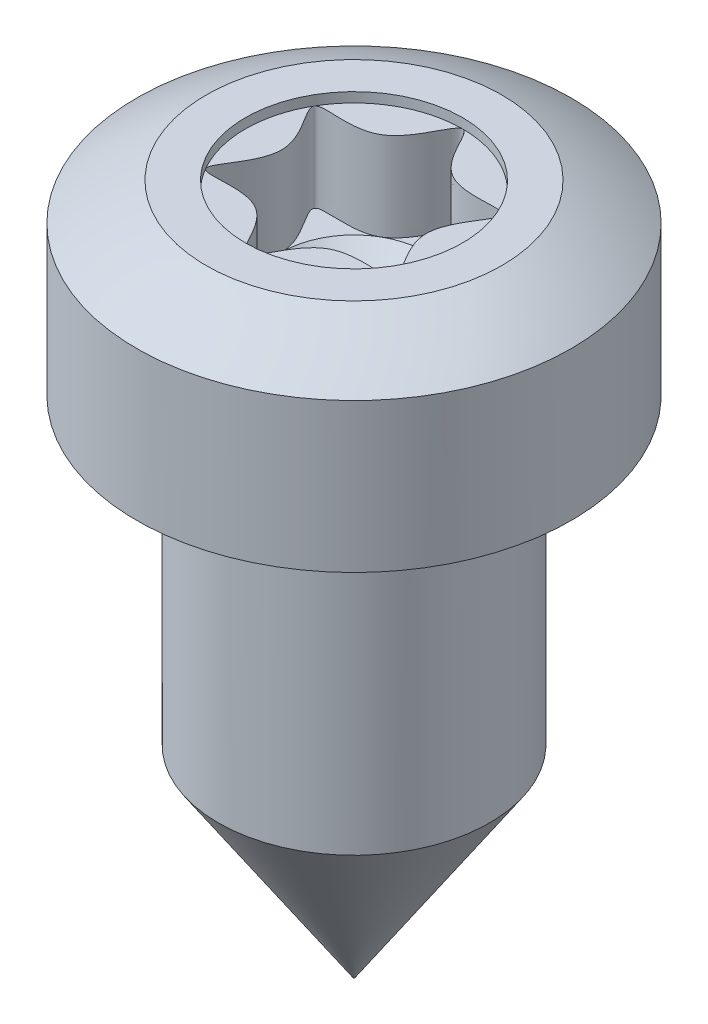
ISO-10303-21;
HEADER;
FILE_DESCRIPTION(('STEP AP214'),'2;1');
FILE_NAME('part.step','',(''),(''),'','','');
FILE_SCHEMA(('AUTOMOTIVE_DESIGN { 1 0 10303 214 1 1 1 1 }'));
ENDSEC;
DATA;
#1=APPLICATION_CONTEXT('core data for automotive mechanical design processes');
#2=APPLICATION_PROTOCOL_DEFINITION('international standard','automotive_design',2000,#1);
#3=PRODUCT_CONTEXT('',#1,'mechanical');
#4=PRODUCT('Part','Part','',(#3));
#5=PRODUCT_RELATED_PRODUCT_CATEGORY('part','',(#4));
#6=PRODUCT_DEFINITION_FORMATION('','',#4);
#7=PRODUCT_DEFINITION_CONTEXT('part definition',#1,'design');
#8=PRODUCT_DEFINITION('design','',#6,#7);
#9=PRODUCT_DEFINITION_SHAPE('','',#8);
#10=(LENGTH_UNIT() NAMED_UNIT(*) SI_UNIT(.MILLI.,.METRE.));
#11=(NAMED_UNIT(*) PLANE_ANGLE_UNIT() SI_UNIT($,.RADIAN.));
#12=(NAMED_UNIT(*) SI_UNIT($,.STERADIAN.) SOLID_ANGLE_UNIT());
#13=UNCERTAINTY_MEASURE_WITH_UNIT(LENGTH_MEASURE(1.E-05),#10,'distance_accuracy_value','');
#14=(GEOMETRIC_REPRESENTATION_CONTEXT(3) GLOBAL_UNCERTAINTY_ASSIGNED_CONTEXT((#13)) GLOBAL_UNIT_ASSIGNED_CONTEXT((#10,
#11,#12)) REPRESENTATION_CONTEXT('',''));
#15=CARTESIAN_POINT('',(0.,0.,0.));
#16=DIRECTION('',(0.,0.,1.));
#17=DIRECTION('',(1.,0.,0.));
#18=AXIS2_PLACEMENT_3D('',#15,#16,#17);
#19=CARTESIAN_POINT('',(0.,7.63,1.4));
#20=DIRECTION('',(0.,1.,0.));
#21=DIRECTION('',(0.,0.,1.));
#22=AXIS2_PLACEMENT_3D('',#19,#20,#21);
#23=PLANE('',#22);
#24=CARTESIAN_POINT('',(0.,7.63,-1.4));
#25=CARTESIAN_POINT('',(0.100650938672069,7.63,-1.4));
#26=CARTESIAN_POINT('',(0.301952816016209,7.63,-0.522997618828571));
#27=CARTESIAN_POINT('',(1.59218873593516,7.63,-0.919250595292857));
#28=CARTESIAN_POINT('',(0.603905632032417,7.63,0.));
#29=CARTESIAN_POINT('',(1.59218873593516,7.63,0.919250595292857));
#30=CARTESIAN_POINT('',(0.301952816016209,7.63,0.52299761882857));
#31=CARTESIAN_POINT('',(0.,7.63,1.83850119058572));
#32=CARTESIAN_POINT('',(-0.301952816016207,7.63,0.522997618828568));
#33=CARTESIAN_POINT('',(-1.59218873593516,7.63,0.919250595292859));
#34=CARTESIAN_POINT('',(-0.603905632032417,7.63,0.));
#35=CARTESIAN_POINT('',(-1.59218873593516,7.63,-0.919250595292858));
#36=CARTESIAN_POINT('',(-0.301952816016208,7.63,-0.52299761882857));
#37=CARTESIAN_POINT('',(-0.100650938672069,7.63,-1.4));
#38=CARTESIAN_POINT('',(0.,7.63,-1.4));
#39=B_SPLINE_CURVE_WITH_KNOTS('',3,(#24,#25,#26,#27,#28,#29,#30,#31,#32,#33,#34,#35,#36,#37,
#38),.UNSPECIFIED.,.T.,.F.,(4,1,1,1,1,1,1,1,1,1,1,1,4),(0.,0.0833333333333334,0.166666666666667,
0.25,0.333333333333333,0.416666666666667,0.5,0.583333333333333,0.666666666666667,0.75,
0.833333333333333,0.916666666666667,1.),.UNSPECIFIED.);
#40=CARTESIAN_POINT('',(0.466666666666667,7.63,-0.808290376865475));
#41=VERTEX_POINT('',#40);
#42=CARTESIAN_POINT('',(0.933333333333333,7.63,0.));
#43=VERTEX_POINT('',#42);
#44=EDGE_CURVE('E136',#41,#43,#39,.T.);
#45=ORIENTED_EDGE('',*,*,#44,.F.);
#46=CARTESIAN_POINT('',(0.,7.63,0.));
#47=DIRECTION('',(0.,-1.,0.));
#48=DIRECTION('',(0.,0.,-1.));
#49=AXIS2_PLACEMENT_3D('',#46,#47,#48);
#50=CIRCLE('',#49,0.933333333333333);
#51=EDGE_CURVE('E48',#41,#43,#50,.T.);
#52=ORIENTED_EDGE('',*,*,#51,.T.);
#53=EDGE_LOOP('',(#45,#52));
#54=FACE_BOUND('',#53,.T.);
#55=ADVANCED_FACE('F33',(#54),#23,.T.);
#56=CARTESIAN_POINT('',(0.466666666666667,7.63,0.808290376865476));
#57=VERTEX_POINT('',#56);
#58=EDGE_CURVE('E151',#43,#57,#39,.T.);
#59=ORIENTED_EDGE('',*,*,#58,.F.);
#60=EDGE_CURVE('E190',#43,#57,#50,.T.);
#61=ORIENTED_EDGE('',*,*,#60,.T.);
#62=EDGE_LOOP('',(#59,#61));
#63=FACE_BOUND('',#62,.T.);
#64=ADVANCED_FACE('F103',(#63),#23,.T.);
#65=CARTESIAN_POINT('',(-0.466666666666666,7.63,0.808290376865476));
#66=VERTEX_POINT('',#65);
#67=EDGE_CURVE('E144',#57,#66,#39,.T.);
#68=ORIENTED_EDGE('',*,*,#67,.F.);
#69=EDGE_CURVE('E229',#57,#66,#50,.T.);
#70=ORIENTED_EDGE('',*,*,#69,.T.);
#71=EDGE_LOOP('',(#68,#70));
#72=FACE_BOUND('',#71,.T.);
#73=ADVANCED_FACE('F110',(#72),#23,.T.);
#74=CARTESIAN_POINT('',(-0.933333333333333,7.63,0.));
#75=VERTEX_POINT('',#74);
#76=EDGE_CURVE('E142',#66,#75,#39,.T.);
#77=ORIENTED_EDGE('',*,*,#76,.F.);
#78=EDGE_CURVE('E233',#66,#75,#50,.T.);
#79=ORIENTED_EDGE('',*,*,#78,.T.);
#80=EDGE_LOOP('',(#77,#79));
#81=FACE_BOUND('',#80,.T.);
#82=ADVANCED_FACE('F125',(#81),#23,.T.);
#83=CARTESIAN_POINT('',(-0.466666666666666,7.63,-0.808290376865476));
#84=VERTEX_POINT('',#83);
#85=EDGE_CURVE('E133',#75,#84,#39,.T.);
#86=ORIENTED_EDGE('',*,*,#85,.F.);
#87=EDGE_CURVE('E236',#75,#84,#50,.T.);
#88=ORIENTED_EDGE('',*,*,#87,.T.);
#89=EDGE_LOOP('',(#86,#88));
#90=FACE_BOUND('',#89,.T.);
#91=ADVANCED_FACE('F116',(#90),#23,.T.);
#92=EDGE_CURVE('E129',#84,#41,#39,.T.);
#93=ORIENTED_EDGE('',*,*,#92,.F.);
#94=EDGE_CURVE('E131',#84,#41,#50,.T.);
#95=ORIENTED_EDGE('',*,*,#94,.T.);
#96=EDGE_LOOP('',(#93,#95));
#97=FACE_BOUND('',#96,.T.);
#98=ADVANCED_FACE('F106',(#97),#23,.T.);
#99=CARTESIAN_POINT('',(0.,8.9,0.));
#100=DIRECTION('',(0.,1.,0.));
#101=DIRECTION('',(0.,0.,1.));
#102=AXIS2_PLACEMENT_3D('',#99,#100,#101);
#103=PLANE('',#102);
#104=CARTESIAN_POINT('',(0.,8.9,0.));
#105=DIRECTION('',(0.,1.,0.));
#106=DIRECTION('',(0.,0.,1.));
#107=AXIS2_PLACEMENT_3D('',#104,#105,#106);
#108=CIRCLE('',#107,1.4);
#109=CARTESIAN_POINT('',(0.,8.9,1.4));
#110=VERTEX_POINT('',#109);
#111=EDGE_CURVE('E152',#110,#110,#108,.T.);
#112=ORIENTED_EDGE('',*,*,#111,.F.);
#113=EDGE_LOOP('',(#112));
#114=FACE_BOUND('',#113,.T.);
#115=CARTESIAN_POINT('',(0.,8.9,0.));
#116=DIRECTION('',(0.,1.,0.));
#117=DIRECTION('',(0.,0.,1.));
#118=AXIS2_PLACEMENT_3D('',#115,#116,#117);
#119=CIRCLE('',#118,1.90599986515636);
#120=CARTESIAN_POINT('',(1.90599986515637,8.9,0.));
#121=VERTEX_POINT('',#120);
#122=EDGE_CURVE('E150',#121,#121,#119,.F.);
#123=ORIENTED_EDGE('',*,*,#122,.F.);
#124=EDGE_LOOP('',(#123));
#125=FACE_BOUND('',#124,.T.);
#126=ADVANCED_FACE('F115',(#114,#125),#103,.T.);
#127=CARTESIAN_POINT('',(0.,0.,0.));
#128=DIRECTION('',(0.,-1.,0.));
#129=DIRECTION('',(0.,0.,-1.));
#130=AXIS2_PLACEMENT_3D('',#127,#128,#129);
#131=CYLINDRICAL_SURFACE('',#130,1.75);
#132=CARTESIAN_POINT('',(0.,2.6,0.));
#133=DIRECTION('',(0.,-1.,0.));
#134=DIRECTION('',(0.,0.,-1.));
#135=AXIS2_PLACEMENT_3D('',#132,#133,#134);
#136=CIRCLE('',#135,1.75);
#137=CARTESIAN_POINT('',(0.,2.6,1.75));
#138=VERTEX_POINT('',#137);
#139=EDGE_CURVE('E185',#138,#138,#136,.T.);
#140=ORIENTED_EDGE('',*,*,#139,.F.);
#141=EDGE_LOOP('',(#140));
#142=FACE_BOUND('',#141,.T.);
#143=CARTESIAN_POINT('',(0.,6.4,0.));
#144=DIRECTION('',(0.,-1.,0.));
#145=DIRECTION('',(0.,0.,-1.));
#146=AXIS2_PLACEMENT_3D('',#143,#144,#145);
#147=CIRCLE('',#146,1.75);
#148=CARTESIAN_POINT('',(0.,6.4,-1.75));
#149=VERTEX_POINT('',#148);
#150=EDGE_CURVE('E41',#149,#149,#147,.T.);
#151=ORIENTED_EDGE('',*,*,#150,.T.);
#152=EDGE_LOOP('',(#151));
#153=FACE_BOUND('',#152,.T.);
#154=ADVANCED_FACE('F122',(#142,#153),#131,.T.);
#155=CARTESIAN_POINT('',(2.8,6.5,0.));
#156=DIRECTION('',(0.,-1.,0.));
#157=DIRECTION('',(0.,0.,-1.));
#158=AXIS2_PLACEMENT_3D('',#155,#156,#157);
#159=PLANE('',#158);
#160=CARTESIAN_POINT('',(0.,6.5,0.));
#161=DIRECTION('',(0.,-1.,0.));
#162=DIRECTION('',(0.,0.,-1.));
#163=AXIS2_PLACEMENT_3D('',#160,#161,#162);
#164=CIRCLE('',#163,1.85);
#165=CARTESIAN_POINT('',(0.,6.5,-1.85));
#166=VERTEX_POINT('',#165);
#167=EDGE_CURVE('E11',#166,#166,#164,.F.);
#168=ORIENTED_EDGE('',*,*,#167,.T.);
#169=EDGE_LOOP('',(#168));
#170=FACE_BOUND('',#169,.T.);
#171=CARTESIAN_POINT('',(0.,6.5,0.));
#172=DIRECTION('',(0.,-1.,0.));
#173=DIRECTION('',(0.,0.,-1.));
#174=AXIS2_PLACEMENT_3D('',#171,#172,#173);
#175=CIRCLE('',#174,2.8);
#176=CARTESIAN_POINT('',(0.,6.5,-2.8));
#177=VERTEX_POINT('',#176);
#178=EDGE_CURVE('E214',#177,#177,#175,.T.);
#179=ORIENTED_EDGE('',*,*,#178,.T.);
#180=EDGE_LOOP('',(#179));
#181=FACE_BOUND('',#180,.T.);
#182=ADVANCED_FACE('F168',(#170,#181),#159,.T.);
#183=CARTESIAN_POINT('',(0.,0.,0.));
#184=DIRECTION('',(0.,-1.,0.));
#185=DIRECTION('',(0.,0.,-1.));
#186=AXIS2_PLACEMENT_3D('',#183,#184,#185);
#187=CYLINDRICAL_SURFACE('',#186,2.8);
#188=CARTESIAN_POINT('',(0.,8.42,0.));
#189=DIRECTION('',(0.,-1.,0.));
#190=DIRECTION('',(0.,0.,-1.));
#191=AXIS2_PLACEMENT_3D('',#188,#189,#190);
#192=CIRCLE('',#191,2.8);
#193=CARTESIAN_POINT('',(2.8,8.42,0.));
#194=VERTEX_POINT('',#193);
#195=EDGE_CURVE('E154',#194,#194,#192,.F.);
#196=ORIENTED_EDGE('',*,*,#195,.F.);
#197=EDGE_LOOP('',(#196));
#198=FACE_BOUND('',#197,.T.);
#199=ORIENTED_EDGE('',*,*,#178,.F.);
#200=EDGE_LOOP('',(#199));
#201=FACE_BOUND('',#200,.T.);
#202=ADVANCED_FACE('F163',(#198,#201),#187,.T.);
#203=CARTESIAN_POINT('',(0.,4.2775369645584,0.));
#204=DIRECTION('',(0.,-1.,0.));
#205=DIRECTION('',(1.,0.,0.));
#206=AXIS2_PLACEMENT_3D('',#203,#204,#205);
#207=SPHERICAL_SURFACE('',#206,5.);
#208=CARTESIAN_POINT('',(2.8,8.42,0.));
#209=CARTESIAN_POINT('',(2.7912278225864,8.42592934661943,0.));
#210=CARTESIAN_POINT('',(2.78243681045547,8.43183082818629,0.));
#211=CARTESIAN_POINT('',(2.76481747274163,8.44357782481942,0.));
#212=CARTESIAN_POINT('',(2.75598914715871,8.44942333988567,0.));
#213=CARTESIAN_POINT('',(2.73829553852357,8.46105816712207,0.));
#214=CARTESIAN_POINT('',(2.72943025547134,8.46684747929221,0.));
#215=CARTESIAN_POINT('',(2.71166308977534,8.47836966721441,0.));
#216=CARTESIAN_POINT('',(2.70276120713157,8.48410254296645,0.));
#217=CARTESIAN_POINT('',(2.68492120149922,8.495511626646,0.));
#218=CARTESIAN_POINT('',(2.67598307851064,8.5011878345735,0.));
#219=CARTESIAN_POINT('',(2.65807095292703,8.51248335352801,0.));
#220=CARTESIAN_POINT('',(2.649096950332,8.51810266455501,0.));
#221=CARTESIAN_POINT('',(2.6311134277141,8.52928416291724,0.));
#222=CARTESIAN_POINT('',(2.62210390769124,8.53484635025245,0.));
#223=CARTESIAN_POINT('',(2.60404971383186,8.54591337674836,0.));
#224=CARTESIAN_POINT('',(2.59500503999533,8.55141821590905,0.));
#225=CARTESIAN_POINT('',(2.57688090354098,8.56237032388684,0.));
#226=CARTESIAN_POINT('',(2.56780144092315,8.56781759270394,0.));
#227=CARTESIAN_POINT('',(2.54960809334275,8.57865434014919,0.));
#228=CARTESIAN_POINT('',(2.54049420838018,8.58404381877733,0.));
#229=CARTESIAN_POINT('',(2.52223238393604,8.59476476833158,0.));
#230=CARTESIAN_POINT('',(2.51308444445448,8.60009623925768,0.));
#231=CARTESIAN_POINT('',(2.49475488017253,8.61070095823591,0.));
#232=CARTESIAN_POINT('',(2.48557325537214,8.61597420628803,0.));
#233=CARTESIAN_POINT('',(2.46717669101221,8.62646226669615,0.));
#234=CARTESIAN_POINT('',(2.45796175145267,8.63167707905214,0.));
#235=CARTESIAN_POINT('',(2.43949892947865,8.64204805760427,0.));
#236=CARTESIAN_POINT('',(2.43025104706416,8.64720422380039,0.));
#237=CARTESIAN_POINT('',(2.41172271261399,8.65745770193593,0.));
#238=CARTESIAN_POINT('',(2.4024422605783,8.66255501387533,0.));
#239=CARTESIAN_POINT('',(2.38384916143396,8.67269057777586,0.));
#240=CARTESIAN_POINT('',(2.37453651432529,8.67772882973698,0.));
#241=CARTESIAN_POINT('',(2.35587940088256,8.68774607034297,0.));
#242=CARTESIAN_POINT('',(2.34653493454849,8.69272505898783,0.));
#243=CARTESIAN_POINT('',(2.3278145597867,8.70262357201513,0.));
#244=CARTESIAN_POINT('',(2.31843865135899,8.70754309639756,0.));
#245=CARTESIAN_POINT('',(2.29965577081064,8.71732248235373,0.));
#246=CARTESIAN_POINT('',(2.29024879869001,8.72218234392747,0.));
#247=CARTESIAN_POINT('',(2.27140417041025,8.73184220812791,0.));
#248=CARTESIAN_POINT('',(2.26196651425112,8.7366422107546,0.));
#249=CARTESIAN_POINT('',(2.24306089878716,8.74618216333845,0.));
#250=CARTESIAN_POINT('',(2.23359293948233,8.7509221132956,0.));
#251=CARTESIAN_POINT('',(2.21462709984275,8.76034176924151,0.));
#252=CARTESIAN_POINT('',(2.20512921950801,8.76502147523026,0.));
#253=CARTESIAN_POINT('',(2.18610392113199,8.77432045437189,0.));
#254=CARTESIAN_POINT('',(2.1765765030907,8.77893972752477,0.));
#255=CARTESIAN_POINT('',(2.15749251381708,8.78811765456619,0.));
#256=CARTESIAN_POINT('',(2.14793594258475,8.79267630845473,0.));
#257=CARTESIAN_POINT('',(2.12879403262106,8.80173281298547,0.));
#258=CARTESIAN_POINT('',(2.11920869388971,8.80623066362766,0.));
#259=CARTESIAN_POINT('',(2.10000963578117,8.81516538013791,0.));
#260=CARTESIAN_POINT('',(2.09039591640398,8.81960224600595,0.));
#261=CARTESIAN_POINT('',(2.07114048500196,8.82841481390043,0.));
#262=CARTESIAN_POINT('',(2.06149877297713,8.83279051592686,0.));
#263=CARTESIAN_POINT('',(2.0421877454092,8.8414805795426,0.));
#264=CARTESIAN_POINT('',(2.03251842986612,8.84579494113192,0.));
#265=CARTESIAN_POINT('',(2.01315258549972,8.85436214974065,0.));
#266=CARTESIAN_POINT('',(2.00345605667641,8.85861499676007,0.));
#267=CARTESIAN_POINT('',(1.98403617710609,8.86705900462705,0.));
#268=CARTESIAN_POINT('',(1.97431282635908,8.87125016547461,0.));
#269=CARTESIAN_POINT('',(1.95483969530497,8.87957063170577,0.));
#270=CARTESIAN_POINT('',(1.94508991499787,8.88369993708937,0.));
#271=CARTESIAN_POINT('',(1.92556431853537,8.89189652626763,0.));
#272=CARTESIAN_POINT('',(1.91578850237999,8.89596381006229,0.));
#273=CARTESIAN_POINT('',(1.90599986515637,8.9,0.));
#274=B_SPLINE_CURVE_WITH_KNOTS('',3,(#208,#209,#210,#211,#212,#213,#214,#215,#216,#217,#218,
#219,#220,#221,#222,#223,#224,#225,#226,#227,#228,#229,#230,#231,#232,#233,#234,#235,#236,#237,
#238,#239,#240,#241,#242,#243,#244,#245,#246,#247,#248,#249,#250,#251,#252,#253,#254,#255,#256,
#257,#258,#259,#260,#261,#262,#263,#264,#265,#266,#267,#268,#269,#270,#271,#272,#273),
.UNSPECIFIED.,.F.,.F.,(4,2,2,2,2,2,2,2,2,2,2,2,2,2,2,2,2,2,2,2,2,2,2,2,2,2,2,2,2,2,2,2,4),(0.,
0.0317643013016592,0.0635286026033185,0.0952929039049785,0.127057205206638,0.158821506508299,
0.190585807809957,0.222350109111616,0.254114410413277,0.285878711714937,0.317643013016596,
0.349407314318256,0.381171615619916,0.412935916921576,0.444700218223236,0.476464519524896,
0.508228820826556,0.539993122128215,0.571757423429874,0.603521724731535,0.635286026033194,
0.667050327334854,0.698814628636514,0.730578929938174,0.762343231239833,0.794107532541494,
0.825871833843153,0.857636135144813,0.889400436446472,0.921164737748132,0.952929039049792,
0.984693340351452,1.01645764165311),.UNSPECIFIED.);
#275=EDGE_CURVE('BSEAM160',#194,#121,#274,.T.);
#276=ORIENTED_EDGE('',*,*,#195,.T.);
#277=ORIENTED_EDGE('',*,*,#122,.T.);
#278=ORIENTED_EDGE('',*,*,#275,.T.);
#279=ORIENTED_EDGE('',*,*,#275,.F.);
#280=EDGE_LOOP('',(#276,#278,#277,#279));
#281=FACE_BOUND('',#280,.T.);
#282=ADVANCED_FACE('F160',(#281),#207,.T.);
#283=CARTESIAN_POINT('',(0.,8.773,0.));
#284=DIRECTION('',(0.,1.,0.));
#285=DIRECTION('',(0.,0.,1.));
#286=AXIS2_PLACEMENT_3D('',#283,#284,#285);
#287=CYLINDRICAL_SURFACE('',#286,1.4);
#288=ORIENTED_EDGE('',*,*,#111,.T.);
#289=EDGE_LOOP('',(#288));
#290=FACE_BOUND('',#289,.T.);
#291=CARTESIAN_POINT('',(0.,8.773,0.));
#292=DIRECTION('',(0.,1.,0.));
#293=DIRECTION('',(0.,0.,1.));
#294=AXIS2_PLACEMENT_3D('',#291,#292,#293);
#295=CIRCLE('',#294,1.4);
#296=CARTESIAN_POINT('',(1.21243556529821,8.773,0.699999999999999));
#297=VERTEX_POINT('',#296);
#298=CARTESIAN_POINT('',(1.21243556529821,8.773,-0.7));
#299=VERTEX_POINT('',#298);
#300=EDGE_CURVE('E192',#297,#299,#295,.T.);
#301=ORIENTED_EDGE('',*,*,#300,.F.);
#302=CARTESIAN_POINT('',(0.,8.773,1.4));
#303=VERTEX_POINT('',#302);
#304=EDGE_CURVE('E134',#303,#297,#295,.T.);
#305=ORIENTED_EDGE('',*,*,#304,.F.);
#306=CARTESIAN_POINT('',(-1.21243556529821,8.773,0.700000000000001));
#307=VERTEX_POINT('',#306);
#308=EDGE_CURVE('E193',#307,#303,#295,.T.);
#309=ORIENTED_EDGE('',*,*,#308,.F.);
#310=CARTESIAN_POINT('',(-1.21243556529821,8.773,-0.7));
#311=VERTEX_POINT('',#310);
#312=EDGE_CURVE('E199',#311,#307,#295,.T.);
#313=ORIENTED_EDGE('',*,*,#312,.F.);
#314=CARTESIAN_POINT('',(0.,8.773,-1.4));
#315=VERTEX_POINT('',#314);
#316=EDGE_CURVE('E203',#315,#311,#295,.T.);
#317=ORIENTED_EDGE('',*,*,#316,.F.);
#318=EDGE_CURVE('E55',#299,#315,#295,.T.);
#319=ORIENTED_EDGE('',*,*,#318,.F.);
#320=EDGE_LOOP('',(#301,#305,#309,#313,#317,#319));
#321=FACE_BOUND('',#320,.T.);
#322=ADVANCED_FACE('F162',(#290,#321),#287,.F.);
#323=CARTESIAN_POINT('',(0.,8.773,0.));
#324=DIRECTION('',(0.,1.,0.));
#325=DIRECTION('',(0.,0.,1.));
#326=AXIS2_PLACEMENT_3D('',#323,#324,#325);
#327=PLANE('',#326);
#328=ORIENTED_EDGE('',*,*,#316,.T.);
#329=CARTESIAN_POINT('',(0.,8.773,-1.4));
#330=CARTESIAN_POINT('',(0.100650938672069,8.773,-1.4));
#331=CARTESIAN_POINT('',(0.301952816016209,8.773,-0.522997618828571));
#332=CARTESIAN_POINT('',(1.59218873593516,8.773,-0.919250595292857));
#333=CARTESIAN_POINT('',(0.603905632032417,8.773,0.));
#334=CARTESIAN_POINT('',(1.59218873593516,8.773,0.919250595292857));
#335=CARTESIAN_POINT('',(0.301952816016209,8.773,0.52299761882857));
#336=CARTESIAN_POINT('',(0.,8.773,1.83850119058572));
#337=CARTESIAN_POINT('',(-0.301952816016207,8.773,0.522997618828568));
#338=CARTESIAN_POINT('',(-1.59218873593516,8.773,0.919250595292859));
#339=CARTESIAN_POINT('',(-0.603905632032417,8.773,0.));
#340=CARTESIAN_POINT('',(-1.59218873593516,8.773,-0.919250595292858));
#341=CARTESIAN_POINT('',(-0.301952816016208,8.773,-0.52299761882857));
#342=CARTESIAN_POINT('',(-0.100650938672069,8.773,-1.4));
#343=CARTESIAN_POINT('',(0.,8.773,-1.4));
#344=B_SPLINE_CURVE_WITH_KNOTS('',3,(#329,#330,#331,#332,#333,#334,#335,#336,#337,#338,#339,
#340,#341,#342,#343),.UNSPECIFIED.,.T.,.F.,(4,1,1,1,1,1,1,1,1,1,1,1,4),(0.,0.0833333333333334,
0.166666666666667,0.25,0.333333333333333,0.416666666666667,0.5,0.583333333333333,
0.666666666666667,0.75,0.833333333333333,0.916666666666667,1.),.UNSPECIFIED.);
#345=EDGE_CURVE('E221',#315,#311,#344,.F.);
#346=ORIENTED_EDGE('',*,*,#345,.F.);
#347=EDGE_LOOP('',(#328,#346));
#348=FACE_BOUND('',#347,.T.);
#349=ADVANCED_FACE('F252',(#348),#327,.T.);
#350=ORIENTED_EDGE('',*,*,#312,.T.);
#351=EDGE_CURVE('E239',#311,#307,#344,.F.);
#352=ORIENTED_EDGE('',*,*,#351,.F.);
#353=EDGE_LOOP('',(#350,#352));
#354=FACE_BOUND('',#353,.T.);
#355=ADVANCED_FACE('F254',(#354),#327,.T.);
#356=ORIENTED_EDGE('',*,*,#308,.T.);
#357=EDGE_CURVE('E242',#307,#303,#344,.F.);
#358=ORIENTED_EDGE('',*,*,#357,.F.);
#359=EDGE_LOOP('',(#356,#358));
#360=FACE_BOUND('',#359,.T.);
#361=ADVANCED_FACE('F259',(#360),#327,.T.);
#362=ORIENTED_EDGE('',*,*,#304,.T.);
#363=EDGE_CURVE('E244',#303,#297,#344,.F.);
#364=ORIENTED_EDGE('',*,*,#363,.F.);
#365=EDGE_LOOP('',(#362,#364));
#366=FACE_BOUND('',#365,.T.);
#367=ADVANCED_FACE('F265',(#366),#327,.T.);
#368=ORIENTED_EDGE('',*,*,#300,.T.);
#369=EDGE_CURVE('E220',#297,#299,#344,.F.);
#370=ORIENTED_EDGE('',*,*,#369,.F.);
#371=EDGE_LOOP('',(#368,#370));
#372=FACE_BOUND('',#371,.T.);
#373=ADVANCED_FACE('F248',(#372),#327,.T.);
#374=ORIENTED_EDGE('',*,*,#318,.T.);
#375=EDGE_CURVE('E216',#299,#315,#344,.F.);
#376=ORIENTED_EDGE('',*,*,#375,.F.);
#377=EDGE_LOOP('',(#374,#376));
#378=FACE_BOUND('',#377,.T.);
#379=ADVANCED_FACE('F97',(#378),#327,.T.);
#380=DIRECTION('',(0.,1.,0.));
#381=VECTOR('',#380,1.);
#382=SURFACE_OF_LINEAR_EXTRUSION('',#39,#381);
#383=ORIENTED_EDGE('',*,*,#44,.T.);
#384=ORIENTED_EDGE('',*,*,#58,.T.);
#385=ORIENTED_EDGE('',*,*,#67,.T.);
#386=ORIENTED_EDGE('',*,*,#76,.T.);
#387=ORIENTED_EDGE('',*,*,#85,.T.);
#388=ORIENTED_EDGE('',*,*,#92,.T.);
#389=EDGE_LOOP('',(#383,#384,#385,#386,#387,#388));
#390=FACE_BOUND('',#389,.T.);
#391=ORIENTED_EDGE('',*,*,#375,.T.);
#392=ORIENTED_EDGE('',*,*,#345,.T.);
#393=ORIENTED_EDGE('',*,*,#351,.T.);
#394=ORIENTED_EDGE('',*,*,#357,.T.);
#395=ORIENTED_EDGE('',*,*,#363,.T.);
#396=ORIENTED_EDGE('',*,*,#369,.T.);
#397=EDGE_LOOP('',(#391,#392,#393,#394,#395,#396));
#398=FACE_BOUND('',#397,.T.);
#399=ADVANCED_FACE('F89',(#390,#398),#382,.T.);
#400=CARTESIAN_POINT('',(0.,6.74,0.));
#401=DIRECTION('',(0.,1.,0.));
#402=DIRECTION('',(0.,0.,1.));
#403=AXIS2_PLACEMENT_3D('',#400,#401,#402);
#404=CONICAL_SURFACE('',#403,0.,0.809159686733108);
#405=ORIENTED_EDGE('',*,*,#51,.F.);
#406=ORIENTED_EDGE('',*,*,#94,.F.);
#407=ORIENTED_EDGE('',*,*,#87,.F.);
#408=ORIENTED_EDGE('',*,*,#78,.F.);
#409=ORIENTED_EDGE('',*,*,#69,.F.);
#410=ORIENTED_EDGE('',*,*,#60,.F.);
#411=EDGE_LOOP('',(#405,#406,#407,#408,#409,#410));
#412=FACE_BOUND('',#411,.T.);
#413=CARTESIAN_POINT('',(0.,6.74,0.));
#414=VERTEX_POINT('',#413);
#415=VERTEX_LOOP('',#414);
#416=FACE_BOUND('',#415,.T.);
#417=ADVANCED_FACE('F87',(#412,#416),#404,.F.);
#418=CARTESIAN_POINT('',(0.,6.4,0.));
#419=DIRECTION('',(0.,-1.,0.));
#420=DIRECTION('',(0.,0.,-1.));
#421=AXIS2_PLACEMENT_3D('',#418,#419,#420);
#422=TOROIDAL_SURFACE('',#421,1.85,0.1);
#423=ORIENTED_EDGE('',*,*,#167,.F.);
#424=EDGE_LOOP('',(#423));
#425=FACE_BOUND('',#424,.T.);
#426=ORIENTED_EDGE('',*,*,#150,.F.);
#427=EDGE_LOOP('',(#426));
#428=FACE_BOUND('',#427,.T.);
#429=ADVANCED_FACE('F35',(#425,#428),#422,.F.);
#430=CARTESIAN_POINT('',(0.,2.6,0.));
#431=DIRECTION('',(0.,1.,0.));
#432=DIRECTION('',(0.,0.,1.));
#433=AXIS2_PLACEMENT_3D('',#430,#431,#432);
#434=CONICAL_SURFACE('',#433,1.75,0.58977565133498);
#435=CARTESIAN_POINT('',(0.,0.,0.));
#436=DIRECTION('',(0.,-1.,0.));
#437=DIRECTION('',(0.,0.,-1.));
#438=AXIS2_PLACEMENT_3D('',#435,#436,#437);
#439=CIRCLE('',#438,0.01);
#440=CARTESIAN_POINT('',(0.,0.,0.00999999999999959));
#441=VERTEX_POINT('',#440);
#442=EDGE_CURVE('E184',#441,#441,#439,.T.);
#443=CARTESIAN_POINT('',(0.,0.,0.00999999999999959));
#444=CARTESIAN_POINT('',(0.,0.0270833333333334,0.0281249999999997));
#445=CARTESIAN_POINT('',(0.,0.0541666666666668,0.0462499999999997));
#446=CARTESIAN_POINT('',(0.,0.108333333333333,0.0824999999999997));
#447=CARTESIAN_POINT('',(0.,0.135416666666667,0.100625));
#448=CARTESIAN_POINT('',(0.,0.189583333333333,0.136875));
#449=CARTESIAN_POINT('',(0.,0.216666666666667,0.155));
#450=CARTESIAN_POINT('',(0.,0.270833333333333,0.19125));
#451=CARTESIAN_POINT('',(0.,0.297916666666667,0.209375));
#452=CARTESIAN_POINT('',(0.,0.352083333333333,0.245625));
#453=CARTESIAN_POINT('',(0.,0.379166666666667,0.26375));
#454=CARTESIAN_POINT('',(0.,0.433333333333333,0.3));
#455=CARTESIAN_POINT('',(0.,0.460416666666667,0.318125));
#456=CARTESIAN_POINT('',(0.,0.514583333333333,0.354375));
#457=CARTESIAN_POINT('',(0.,0.541666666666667,0.3725));
#458=CARTESIAN_POINT('',(0.,0.595833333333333,0.40875));
#459=CARTESIAN_POINT('',(0.,0.622916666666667,0.426875));
#460=CARTESIAN_POINT('',(0.,0.677083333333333,0.463125));
#461=CARTESIAN_POINT('',(0.,0.704166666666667,0.48125));
#462=CARTESIAN_POINT('',(0.,0.758333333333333,0.5175));
#463=CARTESIAN_POINT('',(0.,0.785416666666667,0.535625));
#464=CARTESIAN_POINT('',(0.,0.839583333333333,0.571875));
#465=CARTESIAN_POINT('',(0.,0.866666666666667,0.59));
#466=CARTESIAN_POINT('',(0.,0.920833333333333,0.62625));
#467=CARTESIAN_POINT('',(0.,0.947916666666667,0.644375));
#468=CARTESIAN_POINT('',(0.,1.00208333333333,0.680625));
#469=CARTESIAN_POINT('',(0.,1.02916666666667,0.69875));
#470=CARTESIAN_POINT('',(0.,1.08333333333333,0.735));
#471=CARTESIAN_POINT('',(0.,1.11041666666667,0.753125));
#472=CARTESIAN_POINT('',(0.,1.16458333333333,0.789375));
#473=CARTESIAN_POINT('',(0.,1.19166666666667,0.8075));
#474=CARTESIAN_POINT('',(0.,1.24583333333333,0.84375));
#475=CARTESIAN_POINT('',(0.,1.27291666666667,0.861875));
#476=CARTESIAN_POINT('',(0.,1.32708333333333,0.898125));
#477=CARTESIAN_POINT('',(0.,1.35416666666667,0.91625));
#478=CARTESIAN_POINT('',(0.,1.40833333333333,0.9525));
#479=CARTESIAN_POINT('',(0.,1.43541666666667,0.970625));
#480=CARTESIAN_POINT('',(0.,1.48958333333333,1.006875));
#481=CARTESIAN_POINT('',(0.,1.51666666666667,1.025));
#482=CARTESIAN_POINT('',(0.,1.57083333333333,1.06125));
#483=CARTESIAN_POINT('',(0.,1.59791666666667,1.079375));
#484=CARTESIAN_POINT('',(0.,1.65208333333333,1.115625));
#485=CARTESIAN_POINT('',(0.,1.67916666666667,1.13375));
#486=CARTESIAN_POINT('',(0.,1.73333333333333,1.17));
#487=CARTESIAN_POINT('',(0.,1.76041666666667,1.188125));
#488=CARTESIAN_POINT('',(0.,1.81458333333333,1.224375));
#489=CARTESIAN_POINT('',(0.,1.84166666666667,1.2425));
#490=CARTESIAN_POINT('',(0.,1.89583333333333,1.27875));
#491=CARTESIAN_POINT('',(0.,1.92291666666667,1.296875));
#492=CARTESIAN_POINT('',(0.,1.97708333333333,1.333125));
#493=CARTESIAN_POINT('',(0.,2.00416666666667,1.35125));
#494=CARTESIAN_POINT('',(0.,2.05833333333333,1.3875));
#495=CARTESIAN_POINT('',(0.,2.08541666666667,1.405625));
#496=CARTESIAN_POINT('',(0.,2.13958333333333,1.441875));
#497=CARTESIAN_POINT('',(0.,2.16666666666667,1.46));
#498=CARTESIAN_POINT('',(0.,2.22083333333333,1.49625));
#499=CARTESIAN_POINT('',(0.,2.24791666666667,1.514375));
#500=CARTESIAN_POINT('',(0.,2.30208333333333,1.550625));
#501=CARTESIAN_POINT('',(0.,2.32916666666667,1.56875));
#502=CARTESIAN_POINT('',(0.,2.38333333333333,1.605));
#503=CARTESIAN_POINT('',(0.,2.41041666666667,1.623125));
#504=CARTESIAN_POINT('',(0.,2.46458333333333,1.659375));
#505=CARTESIAN_POINT('',(0.,2.49166666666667,1.6775));
#506=CARTESIAN_POINT('',(0.,2.54583333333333,1.71375));
#507=CARTESIAN_POINT('',(0.,2.57291666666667,1.731875));
#508=CARTESIAN_POINT('',(0.,2.6,1.75));
#509=B_SPLINE_CURVE_WITH_KNOTS('',3,(#443,#444,#445,#446,#447,#448,#449,#450,#451,#452,#453,
#454,#455,#456,#457,#458,#459,#460,#461,#462,#463,#464,#465,#466,#467,#468,#469,#470,#471,#472,
#473,#474,#475,#476,#477,#478,#479,#480,#481,#482,#483,#484,#485,#486,#487,#488,#489,#490,#491,
#492,#493,#494,#495,#496,#497,#498,#499,#500,#501,#502,#503,#504,#505,#506,#507,#508),
.UNSPECIFIED.,.F.,.F.,(4,2,2,2,2,2,2,2,2,2,2,2,2,2,2,2,2,2,2,2,2,2,2,2,2,2,2,2,2,2,2,2,4),(0.,
0.0977660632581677,0.195532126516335,0.293298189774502,0.39106425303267,0.488830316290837,
0.586596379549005,0.684362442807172,0.78212850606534,0.879894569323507,0.977660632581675,
1.07542669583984,1.17319275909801,1.27095882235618,1.36872488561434,1.46649094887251,
1.56425701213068,1.66202307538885,1.75978913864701,1.85755520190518,1.95532126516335,
2.05308732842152,2.15085339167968,2.24861945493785,2.34638551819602,2.44415158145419,
2.54191764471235,2.63968370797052,2.73744977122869,2.83521583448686,2.93298189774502,
3.03074796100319,3.12851402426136),.UNSPECIFIED.);
#510=EDGE_CURVE('BSEAM95',#441,#138,#509,.T.);
#511=ORIENTED_EDGE('',*,*,#442,.F.);
#512=ORIENTED_EDGE('',*,*,#139,.T.);
#513=ORIENTED_EDGE('',*,*,#510,.T.);
#514=ORIENTED_EDGE('',*,*,#510,.F.);
#515=EDGE_LOOP('',(#511,#513,#512,#514));
#516=FACE_BOUND('',#515,.T.);
#517=ADVANCED_FACE('F95',(#516),#434,.T.);
#518=CARTESIAN_POINT('',(1.75,0.,0.));
#519=DIRECTION('',(0.,-1.,0.));
#520=DIRECTION('',(0.,0.,-1.));
#521=AXIS2_PLACEMENT_3D('',#518,#519,#520);
#522=PLANE('',#521);
#523=ORIENTED_EDGE('',*,*,#442,.T.);
#524=EDGE_LOOP('',(#523));
#525=FACE_BOUND('',#524,.T.);
#526=ADVANCED_FACE('F175',(#525),#522,.T.);
#527=CLOSED_SHELL('',(#55,#64,#73,#82,#91,#98,#126,#154,#182,#202,#282,#322,#349,#355,#361,#367,
#373,#379,#399,#417,#429,#517,#526));
#528=MANIFOLD_SOLID_BREP('B2',#527);
#529=ADVANCED_BREP_SHAPE_REPRESENTATION('',(#18,#528),#14);
#530=SHAPE_DEFINITION_REPRESENTATION(#9,#529);
ENDSEC;
END-ISO-10303-21;
